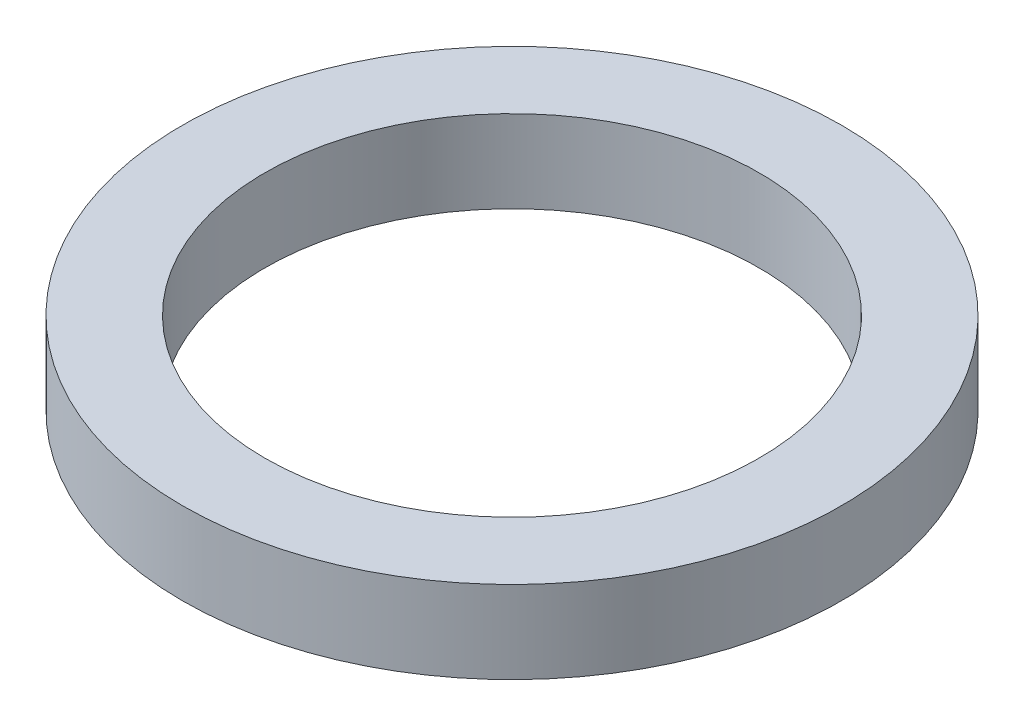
from build123d import *

# Parameters (mm, degrees)
SKETCH1_R           = 8
SKETCH1_R_2         = 6
BOSS_EXTRUDE1_DEPTH = 2


with BuildPart() as part:
    # Sketch1 → Boss-Extrude1 (new body)
    with BuildSketch(Plane(origin=(0, 0, 0), x_dir=(1, 0, 0), z_dir=(0, 1, 0))):
        with Locations(Location((0, 0, 0), (0, 0, 270))):
            Circle(SKETCH1_R)
        with Locations(Location((0, 0, 0), (0, 0, 270))):
            Circle(SKETCH1_R_2, mode=Mode.SUBTRACT)
    extrude(amount=BOSS_EXTRUDE1_DEPTH)


solid = part.part
